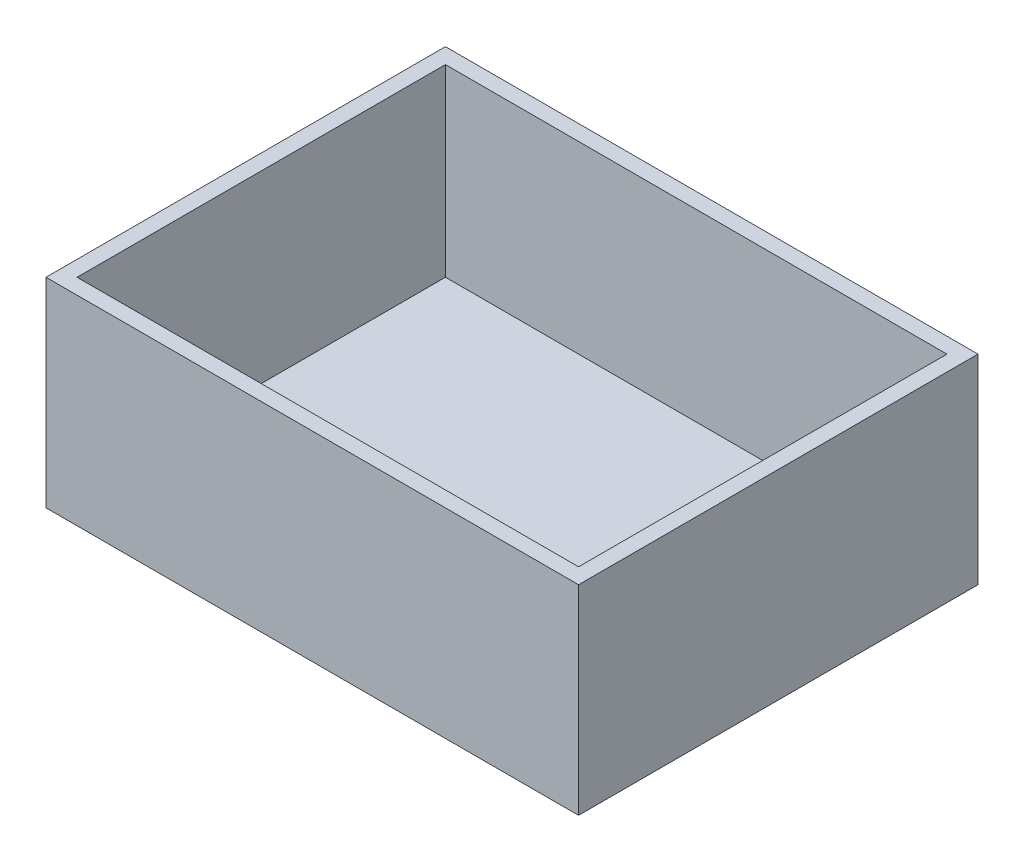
ISO-10303-21;
HEADER;
FILE_DESCRIPTION(('STEP AP214'),'2;1');
FILE_NAME('part.step','',(''),(''),'','','');
FILE_SCHEMA(('AUTOMOTIVE_DESIGN { 1 0 10303 214 1 1 1 1 }'));
ENDSEC;
DATA;
#1=APPLICATION_CONTEXT('core data for automotive mechanical design processes');
#2=APPLICATION_PROTOCOL_DEFINITION('international standard','automotive_design',2000,#1);
#3=PRODUCT_CONTEXT('',#1,'mechanical');
#4=PRODUCT('Part','Part','',(#3));
#5=PRODUCT_RELATED_PRODUCT_CATEGORY('part','',(#4));
#6=PRODUCT_DEFINITION_FORMATION('','',#4);
#7=PRODUCT_DEFINITION_CONTEXT('part definition',#1,'design');
#8=PRODUCT_DEFINITION('design','',#6,#7);
#9=PRODUCT_DEFINITION_SHAPE('','',#8);
#10=(LENGTH_UNIT() NAMED_UNIT(*) SI_UNIT(.MILLI.,.METRE.));
#11=(NAMED_UNIT(*) PLANE_ANGLE_UNIT() SI_UNIT($,.RADIAN.));
#12=(NAMED_UNIT(*) SI_UNIT($,.STERADIAN.) SOLID_ANGLE_UNIT());
#13=UNCERTAINTY_MEASURE_WITH_UNIT(LENGTH_MEASURE(1.E-05),#10,'distance_accuracy_value','');
#14=(GEOMETRIC_REPRESENTATION_CONTEXT(3) GLOBAL_UNCERTAINTY_ASSIGNED_CONTEXT((#13)) GLOBAL_UNIT_ASSIGNED_CONTEXT((#10,
#11,#12)) REPRESENTATION_CONTEXT('',''));
#15=CARTESIAN_POINT('',(0.,0.,0.));
#16=DIRECTION('',(0.,0.,1.));
#17=DIRECTION('',(1.,0.,0.));
#18=AXIS2_PLACEMENT_3D('',#15,#16,#17);
#19=CARTESIAN_POINT('',(60.,45.,45.));
#20=DIRECTION('',(-1.,0.,0.));
#21=DIRECTION('',(0.,0.,1.));
#22=AXIS2_PLACEMENT_3D('',#19,#20,#21);
#23=PLANE('',#22);
#24=DIRECTION('',(0.,0.,-1.));
#25=VECTOR('',#24,1.);
#26=CARTESIAN_POINT('',(60.,0.,45.));
#27=LINE('',#26,#25);
#28=CARTESIAN_POINT('',(60.,0.,45.));
#29=VERTEX_POINT('',#28);
#30=CARTESIAN_POINT('',(60.,0.,-45.));
#31=VERTEX_POINT('',#30);
#32=EDGE_CURVE('E149',#29,#31,#27,.T.);
#33=ORIENTED_EDGE('',*,*,#32,.T.);
#34=DIRECTION('',(0.,-1.,0.));
#35=VECTOR('',#34,1.);
#36=CARTESIAN_POINT('',(60.,45.,-45.));
#37=LINE('',#36,#35);
#38=CARTESIAN_POINT('',(60.,45.,-45.));
#39=VERTEX_POINT('',#38);
#40=EDGE_CURVE('E11',#39,#31,#37,.T.);
#41=ORIENTED_EDGE('',*,*,#40,.F.);
#42=DIRECTION('',(0.,0.,-1.));
#43=VECTOR('',#42,1.);
#44=CARTESIAN_POINT('',(60.,45.,45.));
#45=LINE('',#44,#43);
#46=CARTESIAN_POINT('',(60.,45.,45.));
#47=VERTEX_POINT('',#46);
#48=EDGE_CURVE('E153',#47,#39,#45,.T.);
#49=ORIENTED_EDGE('',*,*,#48,.F.);
#50=DIRECTION('',(0.,-1.,0.));
#51=VECTOR('',#50,1.);
#52=CARTESIAN_POINT('',(60.,45.,45.));
#53=LINE('',#52,#51);
#54=EDGE_CURVE('E157',#47,#29,#53,.T.);
#55=ORIENTED_EDGE('',*,*,#54,.T.);
#56=EDGE_LOOP('',(#33,#41,#49,#55));
#57=FACE_BOUND('',#56,.T.);
#58=ADVANCED_FACE('F41',(#57),#23,.F.);
#59=CARTESIAN_POINT('',(-60.,45.,-45.));
#60=DIRECTION('',(0.,0.,1.));
#61=DIRECTION('',(1.,0.,0.));
#62=AXIS2_PLACEMENT_3D('',#59,#60,#61);
#63=PLANE('',#62);
#64=DIRECTION('',(-1.,0.,0.));
#65=VECTOR('',#64,1.);
#66=CARTESIAN_POINT('',(-60.,0.,-45.));
#67=LINE('',#66,#65);
#68=CARTESIAN_POINT('',(-60.,0.,-45.));
#69=VERTEX_POINT('',#68);
#70=EDGE_CURVE('E165',#31,#69,#67,.T.);
#71=ORIENTED_EDGE('',*,*,#70,.T.);
#72=DIRECTION('',(0.,-1.,0.));
#73=VECTOR('',#72,1.);
#74=CARTESIAN_POINT('',(-60.,45.,-45.));
#75=LINE('',#74,#73);
#76=CARTESIAN_POINT('',(-60.,45.,-45.));
#77=VERTEX_POINT('',#76);
#78=EDGE_CURVE('E48',#77,#69,#75,.T.);
#79=ORIENTED_EDGE('',*,*,#78,.F.);
#80=DIRECTION('',(-1.,0.,0.));
#81=VECTOR('',#80,1.);
#82=CARTESIAN_POINT('',(-60.,45.,-45.));
#83=LINE('',#82,#81);
#84=EDGE_CURVE('E95',#39,#77,#83,.T.);
#85=ORIENTED_EDGE('',*,*,#84,.F.);
#86=ORIENTED_EDGE('',*,*,#40,.T.);
#87=EDGE_LOOP('',(#71,#79,#85,#86));
#88=FACE_BOUND('',#87,.T.);
#89=ADVANCED_FACE('F192',(#88),#63,.F.);
#90=CARTESIAN_POINT('',(-60.,45.,45.));
#91=DIRECTION('',(1.,0.,0.));
#92=DIRECTION('',(0.,0.,-1.));
#93=AXIS2_PLACEMENT_3D('',#90,#91,#92);
#94=PLANE('',#93);
#95=DIRECTION('',(0.,0.,1.));
#96=VECTOR('',#95,1.);
#97=CARTESIAN_POINT('',(-60.,0.,45.));
#98=LINE('',#97,#96);
#99=CARTESIAN_POINT('',(-60.,0.,45.));
#100=VERTEX_POINT('',#99);
#101=EDGE_CURVE('E163',#69,#100,#98,.T.);
#102=ORIENTED_EDGE('',*,*,#101,.T.);
#103=DIRECTION('',(0.,-1.,0.));
#104=VECTOR('',#103,1.);
#105=CARTESIAN_POINT('',(-60.,45.,45.));
#106=LINE('',#105,#104);
#107=CARTESIAN_POINT('',(-60.,45.,45.));
#108=VERTEX_POINT('',#107);
#109=EDGE_CURVE('E169',#108,#100,#106,.T.);
#110=ORIENTED_EDGE('',*,*,#109,.F.);
#111=DIRECTION('',(0.,0.,1.));
#112=VECTOR('',#111,1.);
#113=CARTESIAN_POINT('',(-60.,45.,45.));
#114=LINE('',#113,#112);
#115=EDGE_CURVE('E156',#77,#108,#114,.T.);
#116=ORIENTED_EDGE('',*,*,#115,.F.);
#117=ORIENTED_EDGE('',*,*,#78,.T.);
#118=EDGE_LOOP('',(#102,#110,#116,#117));
#119=FACE_BOUND('',#118,.T.);
#120=ADVANCED_FACE('F172',(#119),#94,.F.);
#121=CARTESIAN_POINT('',(-60.,45.,45.));
#122=DIRECTION('',(0.,0.,-1.));
#123=DIRECTION('',(-1.,0.,0.));
#124=AXIS2_PLACEMENT_3D('',#121,#122,#123);
#125=PLANE('',#124);
#126=DIRECTION('',(1.,0.,0.));
#127=VECTOR('',#126,1.);
#128=CARTESIAN_POINT('',(-60.,0.,45.));
#129=LINE('',#128,#127);
#130=EDGE_CURVE('E85',#100,#29,#129,.T.);
#131=ORIENTED_EDGE('',*,*,#130,.T.);
#132=ORIENTED_EDGE('',*,*,#54,.F.);
#133=DIRECTION('',(1.,0.,0.));
#134=VECTOR('',#133,1.);
#135=CARTESIAN_POINT('',(-60.,45.,45.));
#136=LINE('',#135,#134);
#137=EDGE_CURVE('E65',#108,#47,#136,.T.);
#138=ORIENTED_EDGE('',*,*,#137,.F.);
#139=ORIENTED_EDGE('',*,*,#109,.T.);
#140=EDGE_LOOP('',(#131,#132,#138,#139));
#141=FACE_BOUND('',#140,.T.);
#142=ADVANCED_FACE('F182',(#141),#125,.F.);
#143=CARTESIAN_POINT('',(0.,45.,0.));
#144=DIRECTION('',(0.,-1.,0.));
#145=DIRECTION('',(0.,0.,-1.));
#146=AXIS2_PLACEMENT_3D('',#143,#144,#145);
#147=PLANE('',#146);
#148=DIRECTION('',(-1.,0.,0.));
#149=VECTOR('',#148,1.);
#150=CARTESIAN_POINT('',(-56.5,45.,-41.5));
#151=LINE('',#150,#149);
#152=CARTESIAN_POINT('',(56.5,45.,-41.5));
#153=VERTEX_POINT('',#152);
#154=CARTESIAN_POINT('',(-56.5,45.,-41.5));
#155=VERTEX_POINT('',#154);
#156=EDGE_CURVE('E141',#153,#155,#151,.T.);
#157=ORIENTED_EDGE('',*,*,#156,.F.);
#158=DIRECTION('',(0.,0.,-1.));
#159=VECTOR('',#158,1.);
#160=CARTESIAN_POINT('',(56.5,45.,41.5));
#161=LINE('',#160,#159);
#162=CARTESIAN_POINT('',(56.5,45.,41.5));
#163=VERTEX_POINT('',#162);
#164=EDGE_CURVE('E54',#163,#153,#161,.T.);
#165=ORIENTED_EDGE('',*,*,#164,.F.);
#166=DIRECTION('',(1.,0.,0.));
#167=VECTOR('',#166,1.);
#168=CARTESIAN_POINT('',(-56.5,45.,41.5));
#169=LINE('',#168,#167);
#170=CARTESIAN_POINT('',(-56.5,45.,41.5));
#171=VERTEX_POINT('',#170);
#172=EDGE_CURVE('E135',#171,#163,#169,.T.);
#173=ORIENTED_EDGE('',*,*,#172,.F.);
#174=DIRECTION('',(0.,0.,1.));
#175=VECTOR('',#174,1.);
#176=CARTESIAN_POINT('',(-56.5,45.,41.5));
#177=LINE('',#176,#175);
#178=EDGE_CURVE('E137',#155,#171,#177,.T.);
#179=ORIENTED_EDGE('',*,*,#178,.F.);
#180=EDGE_LOOP('',(#157,#165,#173,#179));
#181=FACE_BOUND('',#180,.T.);
#182=ORIENTED_EDGE('',*,*,#48,.T.);
#183=ORIENTED_EDGE('',*,*,#84,.T.);
#184=ORIENTED_EDGE('',*,*,#115,.T.);
#185=ORIENTED_EDGE('',*,*,#137,.T.);
#186=EDGE_LOOP('',(#182,#183,#184,#185));
#187=FACE_BOUND('',#186,.T.);
#188=ADVANCED_FACE('F181',(#181,#187),#147,.F.);
#189=CARTESIAN_POINT('',(0.,0.,0.));
#190=DIRECTION('',(0.,-1.,0.));
#191=DIRECTION('',(0.,0.,-1.));
#192=AXIS2_PLACEMENT_3D('',#189,#190,#191);
#193=PLANE('',#192);
#194=ORIENTED_EDGE('',*,*,#32,.F.);
#195=ORIENTED_EDGE('',*,*,#130,.F.);
#196=ORIENTED_EDGE('',*,*,#101,.F.);
#197=ORIENTED_EDGE('',*,*,#70,.F.);
#198=EDGE_LOOP('',(#194,#195,#196,#197));
#199=FACE_BOUND('',#198,.T.);
#200=ADVANCED_FACE('F177',(#199),#193,.T.);
#201=CARTESIAN_POINT('',(56.5,3.5,41.5));
#202=DIRECTION('',(1.,0.,0.));
#203=DIRECTION('',(0.,0.,-1.));
#204=AXIS2_PLACEMENT_3D('',#201,#202,#203);
#205=PLANE('',#204);
#206=ORIENTED_EDGE('',*,*,#164,.T.);
#207=DIRECTION('',(0.,1.,0.));
#208=VECTOR('',#207,1.);
#209=CARTESIAN_POINT('',(56.5,3.5,-41.5));
#210=LINE('',#209,#208);
#211=CARTESIAN_POINT('',(56.5,3.5,-41.5));
#212=VERTEX_POINT('',#211);
#213=EDGE_CURVE('E115',#212,#153,#210,.T.);
#214=ORIENTED_EDGE('',*,*,#213,.F.);
#215=DIRECTION('',(0.,0.,-1.));
#216=VECTOR('',#215,1.);
#217=CARTESIAN_POINT('',(56.5,3.5,41.5));
#218=LINE('',#217,#216);
#219=CARTESIAN_POINT('',(56.5,3.5,41.5));
#220=VERTEX_POINT('',#219);
#221=EDGE_CURVE('E118',#220,#212,#218,.T.);
#222=ORIENTED_EDGE('',*,*,#221,.F.);
#223=DIRECTION('',(0.,1.,0.));
#224=VECTOR('',#223,1.);
#225=CARTESIAN_POINT('',(56.5,3.5,41.5));
#226=LINE('',#225,#224);
#227=EDGE_CURVE('E150',#220,#163,#226,.T.);
#228=ORIENTED_EDGE('',*,*,#227,.T.);
#229=EDGE_LOOP('',(#206,#214,#222,#228));
#230=FACE_BOUND('',#229,.T.);
#231=ADVANCED_FACE('F111',(#230),#205,.F.);
#232=CARTESIAN_POINT('',(-56.5,3.5,41.5));
#233=DIRECTION('',(0.,0.,1.));
#234=DIRECTION('',(1.,0.,0.));
#235=AXIS2_PLACEMENT_3D('',#232,#233,#234);
#236=PLANE('',#235);
#237=ORIENTED_EDGE('',*,*,#172,.T.);
#238=ORIENTED_EDGE('',*,*,#227,.F.);
#239=DIRECTION('',(1.,0.,0.));
#240=VECTOR('',#239,1.);
#241=CARTESIAN_POINT('',(-56.5,3.5,41.5));
#242=LINE('',#241,#240);
#243=CARTESIAN_POINT('',(-56.5,3.5,41.5));
#244=VERTEX_POINT('',#243);
#245=EDGE_CURVE('E122',#244,#220,#242,.T.);
#246=ORIENTED_EDGE('',*,*,#245,.F.);
#247=DIRECTION('',(0.,1.,0.));
#248=VECTOR('',#247,1.);
#249=CARTESIAN_POINT('',(-56.5,3.5,41.5));
#250=LINE('',#249,#248);
#251=EDGE_CURVE('E147',#244,#171,#250,.T.);
#252=ORIENTED_EDGE('',*,*,#251,.T.);
#253=EDGE_LOOP('',(#237,#238,#246,#252));
#254=FACE_BOUND('',#253,.T.);
#255=ADVANCED_FACE('F232',(#254),#236,.F.);
#256=CARTESIAN_POINT('',(-56.5,3.5,41.5));
#257=DIRECTION('',(-1.,0.,0.));
#258=DIRECTION('',(0.,0.,1.));
#259=AXIS2_PLACEMENT_3D('',#256,#257,#258);
#260=PLANE('',#259);
#261=ORIENTED_EDGE('',*,*,#178,.T.);
#262=ORIENTED_EDGE('',*,*,#251,.F.);
#263=DIRECTION('',(0.,0.,1.));
#264=VECTOR('',#263,1.);
#265=CARTESIAN_POINT('',(-56.5,3.5,41.5));
#266=LINE('',#265,#264);
#267=CARTESIAN_POINT('',(-56.5,3.5,-41.5));
#268=VERTEX_POINT('',#267);
#269=EDGE_CURVE('E128',#268,#244,#266,.T.);
#270=ORIENTED_EDGE('',*,*,#269,.F.);
#271=DIRECTION('',(0.,1.,0.));
#272=VECTOR('',#271,1.);
#273=CARTESIAN_POINT('',(-56.5,3.5,-41.5));
#274=LINE('',#273,#272);
#275=EDGE_CURVE('E121',#268,#155,#274,.T.);
#276=ORIENTED_EDGE('',*,*,#275,.T.);
#277=EDGE_LOOP('',(#261,#262,#270,#276));
#278=FACE_BOUND('',#277,.T.);
#279=ADVANCED_FACE('F243',(#278),#260,.F.);
#280=CARTESIAN_POINT('',(-56.5,3.5,-41.5));
#281=DIRECTION('',(0.,0.,-1.));
#282=DIRECTION('',(-1.,0.,0.));
#283=AXIS2_PLACEMENT_3D('',#280,#281,#282);
#284=PLANE('',#283);
#285=ORIENTED_EDGE('',*,*,#156,.T.);
#286=ORIENTED_EDGE('',*,*,#275,.F.);
#287=DIRECTION('',(-1.,0.,0.));
#288=VECTOR('',#287,1.);
#289=CARTESIAN_POINT('',(-56.5,3.5,-41.5));
#290=LINE('',#289,#288);
#291=EDGE_CURVE('E125',#212,#268,#290,.T.);
#292=ORIENTED_EDGE('',*,*,#291,.F.);
#293=ORIENTED_EDGE('',*,*,#213,.T.);
#294=EDGE_LOOP('',(#285,#286,#292,#293));
#295=FACE_BOUND('',#294,.T.);
#296=ADVANCED_FACE('F127',(#295),#284,.F.);
#297=CARTESIAN_POINT('',(0.,3.5,0.));
#298=DIRECTION('',(0.,-1.,0.));
#299=DIRECTION('',(0.,0.,-1.));
#300=AXIS2_PLACEMENT_3D('',#297,#298,#299);
#301=PLANE('',#300);
#302=ORIENTED_EDGE('',*,*,#221,.T.);
#303=ORIENTED_EDGE('',*,*,#291,.T.);
#304=ORIENTED_EDGE('',*,*,#269,.T.);
#305=ORIENTED_EDGE('',*,*,#245,.T.);
#306=EDGE_LOOP('',(#302,#303,#304,#305));
#307=FACE_BOUND('',#306,.T.);
#308=ADVANCED_FACE('F134',(#307),#301,.F.);
#309=CLOSED_SHELL('',(#58,#89,#120,#142,#188,#200,#231,#255,#279,#296,#308));
#310=MANIFOLD_SOLID_BREP('B2',#309);
#311=ADVANCED_BREP_SHAPE_REPRESENTATION('',(#18,#310),#14);
#312=SHAPE_DEFINITION_REPRESENTATION(#9,#311);
ENDSEC;
END-ISO-10303-21;
